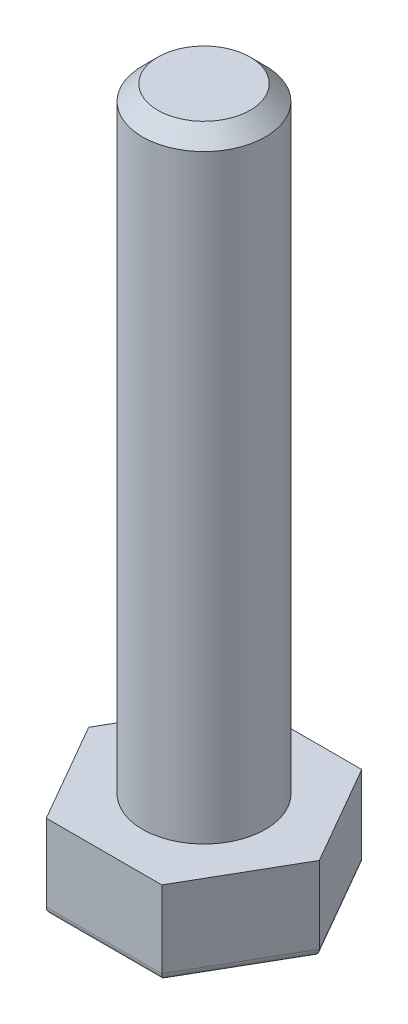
ISO-10303-21;
HEADER;
FILE_DESCRIPTION(('STEP AP214'),'2;1');
FILE_NAME('part.step','',(''),(''),'','','');
FILE_SCHEMA(('AUTOMOTIVE_DESIGN { 1 0 10303 214 1 1 1 1 }'));
ENDSEC;
DATA;
#1=APPLICATION_CONTEXT('core data for automotive mechanical design processes');
#2=APPLICATION_PROTOCOL_DEFINITION('international standard','automotive_design',2000,#1);
#3=PRODUCT_CONTEXT('',#1,'mechanical');
#4=PRODUCT('Part','Part','',(#3));
#5=PRODUCT_RELATED_PRODUCT_CATEGORY('part','',(#4));
#6=PRODUCT_DEFINITION_FORMATION('','',#4);
#7=PRODUCT_DEFINITION_CONTEXT('part definition',#1,'design');
#8=PRODUCT_DEFINITION('design','',#6,#7);
#9=PRODUCT_DEFINITION_SHAPE('','',#8);
#10=(LENGTH_UNIT() NAMED_UNIT(*) SI_UNIT(.MILLI.,.METRE.));
#11=(NAMED_UNIT(*) PLANE_ANGLE_UNIT() SI_UNIT($,.RADIAN.));
#12=(NAMED_UNIT(*) SI_UNIT($,.STERADIAN.) SOLID_ANGLE_UNIT());
#13=UNCERTAINTY_MEASURE_WITH_UNIT(LENGTH_MEASURE(1.E-05),#10,'distance_accuracy_value','');
#14=(GEOMETRIC_REPRESENTATION_CONTEXT(3) GLOBAL_UNCERTAINTY_ASSIGNED_CONTEXT((#13)) GLOBAL_UNIT_ASSIGNED_CONTEXT((#10,
#11,#12)) REPRESENTATION_CONTEXT('',''));
#15=CARTESIAN_POINT('',(0.,0.,0.));
#16=DIRECTION('',(0.,0.,1.));
#17=DIRECTION('',(1.,0.,0.));
#18=AXIS2_PLACEMENT_3D('',#15,#16,#17);
#19=CARTESIAN_POINT('',(3.75834261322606,5.5,6.5));
#20=DIRECTION('',(0.,1.,0.));
#21=DIRECTION('',(0.,0.,1.));
#22=AXIS2_PLACEMENT_3D('',#19,#20,#21);
#23=PLANE('',#22);
#24=DIRECTION('',(1.,0.,0.));
#25=VECTOR('',#24,1.);
#26=CARTESIAN_POINT('',(-3.75834261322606,5.5,6.5));
#27=LINE('',#26,#25);
#28=CARTESIAN_POINT('',(-3.75834261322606,5.5,6.5));
#29=VERTEX_POINT('',#28);
#30=CARTESIAN_POINT('',(3.75834261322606,5.5,6.5));
#31=VERTEX_POINT('',#30);
#32=EDGE_CURVE('E110',#29,#31,#27,.T.);
#33=ORIENTED_EDGE('',*,*,#32,.T.);
#34=DIRECTION('',(0.498887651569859,0.,-0.866666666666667));
#35=VECTOR('',#34,1.);
#36=CARTESIAN_POINT('',(3.75834261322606,5.5,6.5));
#37=LINE('',#36,#35);
#38=CARTESIAN_POINT('',(7.5,5.5,0.));
#39=VERTEX_POINT('',#38);
#40=EDGE_CURVE('E102',#31,#39,#37,.T.);
#41=ORIENTED_EDGE('',*,*,#40,.T.);
#42=DIRECTION('',(-0.498887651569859,0.,-0.866666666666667));
#43=VECTOR('',#42,1.);
#44=CARTESIAN_POINT('',(3.75834261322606,5.5,-6.5));
#45=LINE('',#44,#43);
#46=CARTESIAN_POINT('',(3.75834261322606,5.5,-6.5));
#47=VERTEX_POINT('',#46);
#48=EDGE_CURVE('E109',#39,#47,#45,.T.);
#49=ORIENTED_EDGE('',*,*,#48,.T.);
#50=DIRECTION('',(-1.,0.,0.));
#51=VECTOR('',#50,1.);
#52=CARTESIAN_POINT('',(-3.75834261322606,5.5,-6.5));
#53=LINE('',#52,#51);
#54=CARTESIAN_POINT('',(-3.75834261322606,5.5,-6.5));
#55=VERTEX_POINT('',#54);
#56=EDGE_CURVE('E335',#47,#55,#53,.T.);
#57=ORIENTED_EDGE('',*,*,#56,.T.);
#58=DIRECTION('',(-0.498887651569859,0.,0.866666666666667));
#59=VECTOR('',#58,1.);
#60=CARTESIAN_POINT('',(-3.75834261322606,5.5,-6.5));
#61=LINE('',#60,#59);
#62=CARTESIAN_POINT('',(-7.5,5.5,0.));
#63=VERTEX_POINT('',#62);
#64=EDGE_CURVE('E337',#55,#63,#61,.T.);
#65=ORIENTED_EDGE('',*,*,#64,.T.);
#66=DIRECTION('',(0.498887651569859,0.,0.866666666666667));
#67=VECTOR('',#66,1.);
#68=CARTESIAN_POINT('',(-3.75834261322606,5.5,6.5));
#69=LINE('',#68,#67);
#70=EDGE_CURVE('E115',#63,#29,#69,.T.);
#71=ORIENTED_EDGE('',*,*,#70,.T.);
#72=EDGE_LOOP('',(#33,#41,#49,#57,#65,#71));
#73=FACE_BOUND('',#72,.T.);
#74=CARTESIAN_POINT('',(0.,5.5,0.));
#75=DIRECTION('',(0.,1.,0.));
#76=DIRECTION('',(0.,0.,1.));
#77=AXIS2_PLACEMENT_3D('',#74,#75,#76);
#78=CIRCLE('',#77,4.);
#79=CARTESIAN_POINT('',(0.,5.5,4.));
#80=VERTEX_POINT('',#79);
#81=EDGE_CURVE('E316',#80,#80,#78,.T.);
#82=ORIENTED_EDGE('',*,*,#81,.F.);
#83=EDGE_LOOP('',(#82));
#84=FACE_BOUND('',#83,.T.);
#85=ADVANCED_FACE('F31',(#73,#84),#23,.T.);
#86=CARTESIAN_POINT('',(-3.75834261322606,5.5,6.5));
#87=DIRECTION('',(0.,0.,-1.));
#88=DIRECTION('',(-1.,0.,0.));
#89=AXIS2_PLACEMENT_3D('',#86,#87,#88);
#90=PLANE('',#89);
#91=DIRECTION('',(0.,-1.,0.));
#92=VECTOR('',#91,1.);
#93=CARTESIAN_POINT('',(-3.75834261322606,5.5,6.5));
#94=LINE('',#93,#92);
#95=CARTESIAN_POINT('',(-3.75834261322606,0.5,6.5));
#96=VERTEX_POINT('',#95);
#97=EDGE_CURVE('E340',#29,#96,#94,.T.);
#98=ORIENTED_EDGE('',*,*,#97,.T.);
#99=DIRECTION('',(1.,0.,0.));
#100=VECTOR('',#99,1.);
#101=CARTESIAN_POINT('',(-3.75834261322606,0.5,6.5));
#102=LINE('',#101,#100);
#103=CARTESIAN_POINT('',(3.75834261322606,0.5,6.5));
#104=VERTEX_POINT('',#103);
#105=EDGE_CURVE('E46',#96,#104,#102,.T.);
#106=ORIENTED_EDGE('',*,*,#105,.T.);
#107=DIRECTION('',(0.,-1.,0.));
#108=VECTOR('',#107,1.);
#109=CARTESIAN_POINT('',(3.75834261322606,5.5,6.5));
#110=LINE('',#109,#108);
#111=EDGE_CURVE('E105',#31,#104,#110,.T.);
#112=ORIENTED_EDGE('',*,*,#111,.F.);
#113=ORIENTED_EDGE('',*,*,#32,.F.);
#114=EDGE_LOOP('',(#98,#106,#112,#113));
#115=FACE_BOUND('',#114,.T.);
#116=ADVANCED_FACE('F33',(#115),#90,.F.);
#117=CARTESIAN_POINT('',(3.75834261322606,5.5,6.5));
#118=DIRECTION('',(-0.866666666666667,0.,-0.498887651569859));
#119=DIRECTION('',(-0.498887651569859,0.,0.866666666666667));
#120=AXIS2_PLACEMENT_3D('',#117,#118,#119);
#121=PLANE('',#120);
#122=ORIENTED_EDGE('',*,*,#111,.T.);
#123=DIRECTION('',(0.498887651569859,0.,-0.866666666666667));
#124=VECTOR('',#123,1.);
#125=CARTESIAN_POINT('',(3.75834261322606,0.5,6.5));
#126=LINE('',#125,#124);
#127=CARTESIAN_POINT('',(7.5,0.5,0.));
#128=VERTEX_POINT('',#127);
#129=EDGE_CURVE('E53',#104,#128,#126,.T.);
#130=ORIENTED_EDGE('',*,*,#129,.T.);
#131=DIRECTION('',(0.,-1.,0.));
#132=VECTOR('',#131,1.);
#133=CARTESIAN_POINT('',(7.5,5.5,0.));
#134=LINE('',#133,#132);
#135=EDGE_CURVE('E106',#39,#128,#134,.T.);
#136=ORIENTED_EDGE('',*,*,#135,.F.);
#137=ORIENTED_EDGE('',*,*,#40,.F.);
#138=EDGE_LOOP('',(#122,#130,#136,#137));
#139=FACE_BOUND('',#138,.T.);
#140=ADVANCED_FACE('F104',(#139),#121,.F.);
#141=CARTESIAN_POINT('',(3.75834261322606,5.5,-6.5));
#142=DIRECTION('',(-0.866666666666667,0.,0.498887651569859));
#143=DIRECTION('',(0.498887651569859,0.,0.866666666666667));
#144=AXIS2_PLACEMENT_3D('',#141,#142,#143);
#145=PLANE('',#144);
#146=ORIENTED_EDGE('',*,*,#135,.T.);
#147=DIRECTION('',(-0.498887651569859,0.,-0.866666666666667));
#148=VECTOR('',#147,1.);
#149=CARTESIAN_POINT('',(3.75834261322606,0.5,-6.5));
#150=LINE('',#149,#148);
#151=CARTESIAN_POINT('',(3.75834261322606,0.5,-6.5));
#152=VERTEX_POINT('',#151);
#153=EDGE_CURVE('E144',#128,#152,#150,.T.);
#154=ORIENTED_EDGE('',*,*,#153,.T.);
#155=DIRECTION('',(0.,-1.,0.));
#156=VECTOR('',#155,1.);
#157=CARTESIAN_POINT('',(3.75834261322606,5.5,-6.5));
#158=LINE('',#157,#156);
#159=EDGE_CURVE('E124',#47,#152,#158,.T.);
#160=ORIENTED_EDGE('',*,*,#159,.F.);
#161=ORIENTED_EDGE('',*,*,#48,.F.);
#162=EDGE_LOOP('',(#146,#154,#160,#161));
#163=FACE_BOUND('',#162,.T.);
#164=ADVANCED_FACE('F182',(#163),#145,.F.);
#165=CARTESIAN_POINT('',(-3.75834261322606,5.5,-6.5));
#166=DIRECTION('',(0.,0.,1.));
#167=DIRECTION('',(1.,0.,0.));
#168=AXIS2_PLACEMENT_3D('',#165,#166,#167);
#169=PLANE('',#168);
#170=ORIENTED_EDGE('',*,*,#159,.T.);
#171=DIRECTION('',(-1.,0.,0.));
#172=VECTOR('',#171,1.);
#173=CARTESIAN_POINT('',(-3.75834261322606,0.5,-6.5));
#174=LINE('',#173,#172);
#175=CARTESIAN_POINT('',(-3.75834261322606,0.5,-6.5));
#176=VERTEX_POINT('',#175);
#177=EDGE_CURVE('E142',#152,#176,#174,.T.);
#178=ORIENTED_EDGE('',*,*,#177,.T.);
#179=DIRECTION('',(0.,-1.,0.));
#180=VECTOR('',#179,1.);
#181=CARTESIAN_POINT('',(-3.75834261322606,5.5,-6.5));
#182=LINE('',#181,#180);
#183=EDGE_CURVE('E345',#55,#176,#182,.T.);
#184=ORIENTED_EDGE('',*,*,#183,.F.);
#185=ORIENTED_EDGE('',*,*,#56,.F.);
#186=EDGE_LOOP('',(#170,#178,#184,#185));
#187=FACE_BOUND('',#186,.T.);
#188=ADVANCED_FACE('F178',(#187),#169,.F.);
#189=CARTESIAN_POINT('',(-3.75834261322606,5.5,-6.5));
#190=DIRECTION('',(0.866666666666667,0.,0.498887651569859));
#191=DIRECTION('',(0.498887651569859,0.,-0.866666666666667));
#192=AXIS2_PLACEMENT_3D('',#189,#190,#191);
#193=PLANE('',#192);
#194=ORIENTED_EDGE('',*,*,#183,.T.);
#195=DIRECTION('',(-0.498887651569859,0.,0.866666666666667));
#196=VECTOR('',#195,1.);
#197=CARTESIAN_POINT('',(-3.75834261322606,0.5,-6.5));
#198=LINE('',#197,#196);
#199=CARTESIAN_POINT('',(-7.5,0.5,0.));
#200=VERTEX_POINT('',#199);
#201=EDGE_CURVE('E140',#176,#200,#198,.T.);
#202=ORIENTED_EDGE('',*,*,#201,.T.);
#203=DIRECTION('',(0.,-1.,0.));
#204=VECTOR('',#203,1.);
#205=CARTESIAN_POINT('',(-7.5,5.5,0.));
#206=LINE('',#205,#204);
#207=EDGE_CURVE('E342',#63,#200,#206,.T.);
#208=ORIENTED_EDGE('',*,*,#207,.F.);
#209=ORIENTED_EDGE('',*,*,#64,.F.);
#210=EDGE_LOOP('',(#194,#202,#208,#209));
#211=FACE_BOUND('',#210,.T.);
#212=ADVANCED_FACE('F174',(#211),#193,.F.);
#213=CARTESIAN_POINT('',(-3.75834261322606,5.5,6.5));
#214=DIRECTION('',(0.866666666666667,0.,-0.498887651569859));
#215=DIRECTION('',(-0.498887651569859,0.,-0.866666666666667));
#216=AXIS2_PLACEMENT_3D('',#213,#214,#215);
#217=PLANE('',#216);
#218=ORIENTED_EDGE('',*,*,#207,.T.);
#219=DIRECTION('',(0.498887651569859,0.,0.866666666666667));
#220=VECTOR('',#219,1.);
#221=CARTESIAN_POINT('',(-3.75834261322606,0.5,6.5));
#222=LINE('',#221,#220);
#223=EDGE_CURVE('E119',#200,#96,#222,.T.);
#224=ORIENTED_EDGE('',*,*,#223,.T.);
#225=ORIENTED_EDGE('',*,*,#97,.F.);
#226=ORIENTED_EDGE('',*,*,#70,.F.);
#227=EDGE_LOOP('',(#218,#224,#225,#226));
#228=FACE_BOUND('',#227,.T.);
#229=ADVANCED_FACE('F171',(#228),#217,.F.);
#230=CARTESIAN_POINT('',(3.75834261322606,0.,6.5));
#231=DIRECTION('',(0.,1.,0.));
#232=DIRECTION('',(0.,0.,1.));
#233=AXIS2_PLACEMENT_3D('',#230,#231,#232);
#234=PLANE('',#233);
#235=DIRECTION('',(1.,0.,0.));
#236=VECTOR('',#235,1.);
#237=CARTESIAN_POINT('',(3.75834261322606,0.,6.));
#238=LINE('',#237,#236);
#239=CARTESIAN_POINT('',(3.46923933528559,0.,6.));
#240=VERTEX_POINT('',#239);
#241=CARTESIAN_POINT('',(-3.46923933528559,0.,6.));
#242=VERTEX_POINT('',#241);
#243=EDGE_CURVE('E122',#240,#242,#238,.F.);
#244=ORIENTED_EDGE('',*,*,#243,.T.);
#245=DIRECTION('',(0.498887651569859,0.,0.866666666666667));
#246=VECTOR('',#245,1.);
#247=CARTESIAN_POINT('',(-1.45418984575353,0.,9.50054008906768));
#248=LINE('',#247,#246);
#249=CARTESIAN_POINT('',(-6.92307692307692,0.,0.));
#250=VERTEX_POINT('',#249);
#251=EDGE_CURVE('E137',#242,#250,#248,.F.);
#252=ORIENTED_EDGE('',*,*,#251,.T.);
#253=DIRECTION('',(-0.498887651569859,0.,0.866666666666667));
#254=VECTOR('',#253,1.);
#255=CARTESIAN_POINT('',(-7.07499072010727,0.,0.263904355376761));
#256=LINE('',#255,#254);
#257=CARTESIAN_POINT('',(-3.46923933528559,0.,-6.));
#258=VERTEX_POINT('',#257);
#259=EDGE_CURVE('E135',#250,#258,#256,.F.);
#260=ORIENTED_EDGE('',*,*,#259,.T.);
#261=DIRECTION('',(-1.,0.,0.));
#262=VECTOR('',#261,1.);
#263=CARTESIAN_POINT('',(3.75834261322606,0.,-6.));
#264=LINE('',#263,#262);
#265=CARTESIAN_POINT('',(3.46923933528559,0.,-6.));
#266=VERTEX_POINT('',#265);
#267=EDGE_CURVE('E133',#258,#266,#264,.F.);
#268=ORIENTED_EDGE('',*,*,#267,.T.);
#269=DIRECTION('',(-0.498887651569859,0.,-0.866666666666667));
#270=VECTOR('',#269,1.);
#271=CARTESIAN_POINT('',(8.94581015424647,0.,3.51388827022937));
#272=LINE('',#271,#270);
#273=CARTESIAN_POINT('',(6.92307692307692,0.,0.));
#274=VERTEX_POINT('',#273);
#275=EDGE_CURVE('E131',#266,#274,#272,.F.);
#276=ORIENTED_EDGE('',*,*,#275,.T.);
#277=DIRECTION('',(0.498887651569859,0.,-0.866666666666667));
#278=VECTOR('',#277,1.);
#279=CARTESIAN_POINT('',(3.32500927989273,0.,6.25055617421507));
#280=LINE('',#279,#278);
#281=EDGE_CURVE('E129',#274,#240,#280,.F.);
#282=ORIENTED_EDGE('',*,*,#281,.T.);
#283=EDGE_LOOP('',(#244,#252,#260,#268,#276,#282));
#284=FACE_BOUND('',#283,.T.);
#285=ADVANCED_FACE('F169',(#284),#234,.F.);
#286=CARTESIAN_POINT('',(3.32500927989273,0.5,-6.25055617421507));
#287=DIRECTION('',(-0.498887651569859,0.,-0.866666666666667));
#288=DIRECTION('',(-0.866666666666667,0.,0.498887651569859));
#289=AXIS2_PLACEMENT_3D('',#286,#287,#288);
#290=CYLINDRICAL_SURFACE('',#289,0.5);
#291=CARTESIAN_POINT('',(6.92307692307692,0.5,0.));
#292=DIRECTION('',(0.,0.,-1.));
#293=DIRECTION('',(1.,0.,0.));
#294=AXIS2_PLACEMENT_3D('',#291,#292,#293);
#295=ELLIPSE('',#294,0.576923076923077,0.5);
#296=EDGE_CURVE('E329',#274,#128,#295,.F.);
#297=ORIENTED_EDGE('',*,*,#296,.F.);
#298=ORIENTED_EDGE('',*,*,#275,.F.);
#299=CARTESIAN_POINT('',(3.46923933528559,0.5,-6.));
#300=DIRECTION('',(-0.865704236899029,0.,-0.500555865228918));
#301=DIRECTION('',(0.500555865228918,0.,-0.865704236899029));
#302=AXIS2_PLACEMENT_3D('',#299,#300,#301);
#303=ELLIPSE('',#302,0.577564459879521,0.5);
#304=EDGE_CURVE('E117',#152,#266,#303,.T.);
#305=ORIENTED_EDGE('',*,*,#304,.F.);
#306=ORIENTED_EDGE('',*,*,#153,.F.);
#307=EDGE_LOOP('',(#297,#298,#305,#306));
#308=FACE_BOUND('',#307,.T.);
#309=ADVANCED_FACE('F213',(#308),#290,.T.);
#310=CARTESIAN_POINT('',(-3.75834261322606,0.5,-6.));
#311=DIRECTION('',(-1.,0.,0.));
#312=DIRECTION('',(0.,0.,1.));
#313=AXIS2_PLACEMENT_3D('',#310,#311,#312);
#314=CYLINDRICAL_SURFACE('',#313,0.5);
#315=ORIENTED_EDGE('',*,*,#304,.T.);
#316=ORIENTED_EDGE('',*,*,#267,.F.);
#317=CARTESIAN_POINT('',(-3.46923933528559,0.5,-6.));
#318=DIRECTION('',(-0.865704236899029,0.,0.500555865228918));
#319=DIRECTION('',(-0.500555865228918,0.,-0.865704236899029));
#320=AXIS2_PLACEMENT_3D('',#317,#318,#319);
#321=ELLIPSE('',#320,0.577564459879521,0.5);
#322=EDGE_CURVE('E326',#176,#258,#321,.T.);
#323=ORIENTED_EDGE('',*,*,#322,.F.);
#324=ORIENTED_EDGE('',*,*,#177,.F.);
#325=EDGE_LOOP('',(#315,#316,#323,#324));
#326=FACE_BOUND('',#325,.T.);
#327=ADVANCED_FACE('F220',(#326),#314,.T.);
#328=CARTESIAN_POINT('',(3.32500927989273,0.5,6.25055617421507));
#329=DIRECTION('',(0.498887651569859,0.,-0.866666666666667));
#330=DIRECTION('',(-0.866666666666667,0.,-0.498887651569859));
#331=AXIS2_PLACEMENT_3D('',#328,#329,#330);
#332=CYLINDRICAL_SURFACE('',#331,0.5);
#333=ORIENTED_EDGE('',*,*,#296,.T.);
#334=ORIENTED_EDGE('',*,*,#129,.F.);
#335=CARTESIAN_POINT('',(3.46923933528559,0.5,6.));
#336=DIRECTION('',(0.865704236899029,0.,-0.500555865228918));
#337=DIRECTION('',(0.500555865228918,0.,0.865704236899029));
#338=AXIS2_PLACEMENT_3D('',#335,#336,#337);
#339=ELLIPSE('',#338,0.577564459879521,0.5);
#340=EDGE_CURVE('E323',#240,#104,#339,.F.);
#341=ORIENTED_EDGE('',*,*,#340,.F.);
#342=ORIENTED_EDGE('',*,*,#281,.F.);
#343=EDGE_LOOP('',(#333,#334,#341,#342));
#344=FACE_BOUND('',#343,.T.);
#345=ADVANCED_FACE('F227',(#344),#332,.T.);
#346=CARTESIAN_POINT('',(-3.32500927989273,0.5,-6.25055617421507));
#347=DIRECTION('',(-0.498887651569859,0.,0.866666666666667));
#348=DIRECTION('',(0.866666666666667,0.,0.498887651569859));
#349=AXIS2_PLACEMENT_3D('',#346,#347,#348);
#350=CYLINDRICAL_SURFACE('',#349,0.5);
#351=ORIENTED_EDGE('',*,*,#322,.T.);
#352=ORIENTED_EDGE('',*,*,#259,.F.);
#353=CARTESIAN_POINT('',(-6.92307692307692,0.5,0.));
#354=DIRECTION('',(0.,0.,1.));
#355=DIRECTION('',(-1.,0.,0.));
#356=AXIS2_PLACEMENT_3D('',#353,#354,#355);
#357=ELLIPSE('',#356,0.576923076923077,0.5);
#358=EDGE_CURVE('E319',#200,#250,#357,.T.);
#359=ORIENTED_EDGE('',*,*,#358,.F.);
#360=ORIENTED_EDGE('',*,*,#201,.F.);
#361=EDGE_LOOP('',(#351,#352,#359,#360));
#362=FACE_BOUND('',#361,.T.);
#363=ADVANCED_FACE('F235',(#362),#350,.T.);
#364=CARTESIAN_POINT('',(-3.75834261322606,0.5,6.));
#365=DIRECTION('',(1.,0.,0.));
#366=DIRECTION('',(0.,0.,-1.));
#367=AXIS2_PLACEMENT_3D('',#364,#365,#366);
#368=CYLINDRICAL_SURFACE('',#367,0.5);
#369=ORIENTED_EDGE('',*,*,#340,.T.);
#370=ORIENTED_EDGE('',*,*,#105,.F.);
#371=CARTESIAN_POINT('',(-3.46923933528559,0.5,6.));
#372=DIRECTION('',(0.865704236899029,0.,0.500555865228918));
#373=DIRECTION('',(0.500555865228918,0.,-0.865704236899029));
#374=AXIS2_PLACEMENT_3D('',#371,#372,#373);
#375=ELLIPSE('',#374,0.577564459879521,0.5);
#376=EDGE_CURVE('E317',#242,#96,#375,.F.);
#377=ORIENTED_EDGE('',*,*,#376,.F.);
#378=ORIENTED_EDGE('',*,*,#243,.F.);
#379=EDGE_LOOP('',(#369,#370,#377,#378));
#380=FACE_BOUND('',#379,.T.);
#381=ADVANCED_FACE('F243',(#380),#368,.T.);
#382=CARTESIAN_POINT('',(-3.32500927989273,0.5,6.25055617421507));
#383=DIRECTION('',(0.498887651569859,0.,0.866666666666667));
#384=DIRECTION('',(0.866666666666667,0.,-0.498887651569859));
#385=AXIS2_PLACEMENT_3D('',#382,#383,#384);
#386=CYLINDRICAL_SURFACE('',#385,0.5);
#387=ORIENTED_EDGE('',*,*,#358,.T.);
#388=ORIENTED_EDGE('',*,*,#251,.F.);
#389=ORIENTED_EDGE('',*,*,#376,.T.);
#390=ORIENTED_EDGE('',*,*,#223,.F.);
#391=EDGE_LOOP('',(#387,#388,#389,#390));
#392=FACE_BOUND('',#391,.T.);
#393=ADVANCED_FACE('F251',(#392),#386,.T.);
#394=CARTESIAN_POINT('',(0.,45.5,0.));
#395=DIRECTION('',(0.,-1.,0.));
#396=DIRECTION('',(0.,0.,-1.));
#397=AXIS2_PLACEMENT_3D('',#394,#395,#396);
#398=CYLINDRICAL_SURFACE('',#397,4.);
#399=CARTESIAN_POINT('',(0.,44.5,0.));
#400=DIRECTION('',(0.,1.,0.));
#401=DIRECTION('',(0.,0.,1.));
#402=AXIS2_PLACEMENT_3D('',#399,#400,#401);
#403=CIRCLE('',#402,4.);
#404=CARTESIAN_POINT('',(0.,44.5,4.));
#405=VERTEX_POINT('',#404);
#406=EDGE_CURVE('E11',#405,#405,#403,.F.);
#407=ORIENTED_EDGE('',*,*,#406,.T.);
#408=EDGE_LOOP('',(#407));
#409=FACE_BOUND('',#408,.T.);
#410=ORIENTED_EDGE('',*,*,#81,.T.);
#411=EDGE_LOOP('',(#410));
#412=FACE_BOUND('',#411,.T.);
#413=ADVANCED_FACE('F159',(#409,#412),#398,.T.);
#414=CARTESIAN_POINT('',(0.,45.5,0.));
#415=DIRECTION('',(0.,1.,0.));
#416=DIRECTION('',(0.,0.,1.));
#417=AXIS2_PLACEMENT_3D('',#414,#415,#416);
#418=PLANE('',#417);
#419=CARTESIAN_POINT('',(0.,45.5,0.));
#420=DIRECTION('',(0.,1.,0.));
#421=DIRECTION('',(0.,0.,1.));
#422=AXIS2_PLACEMENT_3D('',#419,#420,#421);
#423=CIRCLE('',#422,3.00000000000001);
#424=CARTESIAN_POINT('',(0.,45.5,3.00000000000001));
#425=VERTEX_POINT('',#424);
#426=EDGE_CURVE('E39',#425,#425,#423,.T.);
#427=ORIENTED_EDGE('',*,*,#426,.T.);
#428=EDGE_LOOP('',(#427));
#429=FACE_BOUND('',#428,.T.);
#430=ADVANCED_FACE('F150',(#429),#418,.T.);
#431=CARTESIAN_POINT('',(0.,45.5,0.));
#432=DIRECTION('',(0.,-1.,0.));
#433=DIRECTION('',(0.,0.,-1.));
#434=AXIS2_PLACEMENT_3D('',#431,#432,#433);
#435=CONICAL_SURFACE('',#434,3.00000000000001,0.785398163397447);
#436=ORIENTED_EDGE('',*,*,#406,.F.);
#437=EDGE_LOOP('',(#436));
#438=FACE_BOUND('',#437,.T.);
#439=ORIENTED_EDGE('',*,*,#426,.F.);
#440=EDGE_LOOP('',(#439));
#441=FACE_BOUND('',#440,.T.);
#442=ADVANCED_FACE('F152',(#438,#441),#435,.T.);
#443=CLOSED_SHELL('',(#85,#116,#140,#164,#188,#212,#229,#285,#309,#327,#345,#363,#381,#393,#413,
#430,#442));
#444=MANIFOLD_SOLID_BREP('B2',#443);
#445=ADVANCED_BREP_SHAPE_REPRESENTATION('',(#18,#444),#14);
#446=SHAPE_DEFINITION_REPRESENTATION(#9,#445);
ENDSEC;
END-ISO-10303-21;
